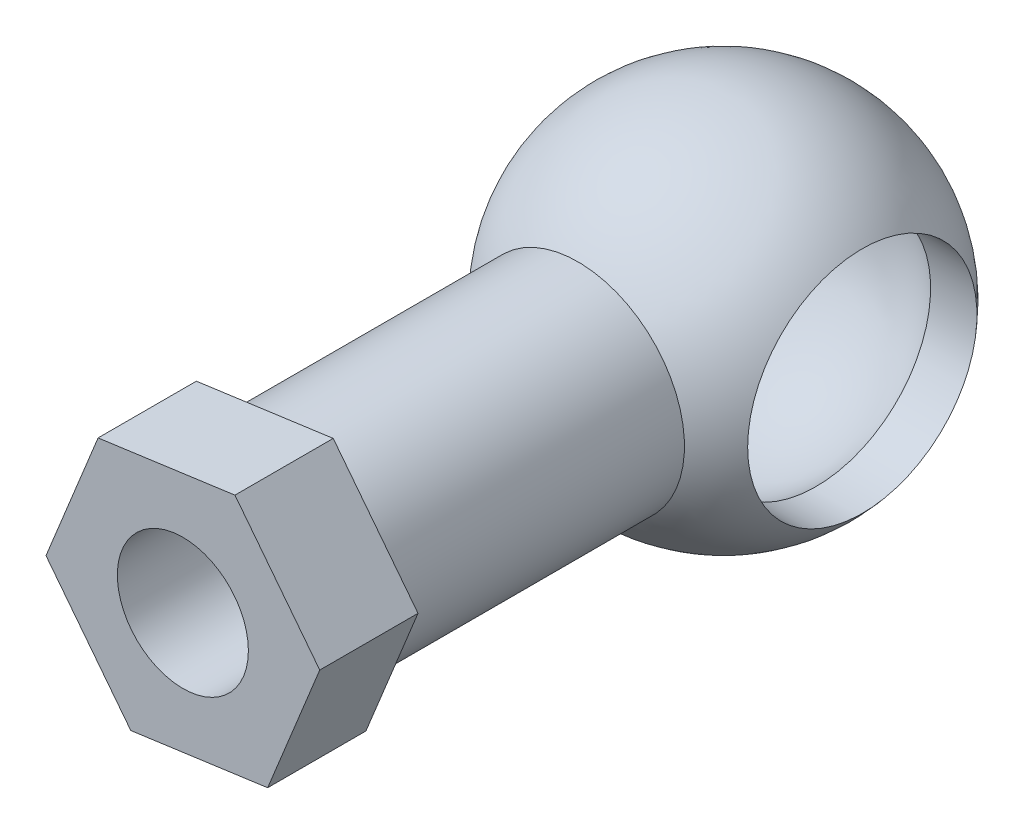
from build123d import *

# Parameters (mm, degrees)
ESQUISSE2_R      = 7
EXTRUSION1_DEPTH = 30
ESQUISSE4_R      = 4
EXTRUSION2_DEPTH = 6


with BuildPart() as part:
    # Esquisse1 → R_volution1 (revolve)
    with BuildSketch(Plane.XY):
        with BuildLine():
            Line((0, 11), (0, 9))
            ThreePointArc((0, 9), (-9, 0), (0, -9))
            Line((0, -9), (0, -11))
            ThreePointArc((0, -11), (-11, 0), (0, 11))
        make_face()
    revolve(axis=Axis((0, 19.125505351, 0), (0, -1, 0)))

    # Esquisse2 → Extrusion1 (cut)
    with BuildSketch(Plane(origin=(0, 0, 0), x_dir=(0, 0, -1), z_dir=(1, 0, 0))):
        with Locations(Location((0, 0, 0), (0, 0, 180))):
            Circle(ESQUISSE2_R)
    extrude(amount=EXTRUSION1_DEPTH, mode=Mode.SUBTRACT)

    # Esquisse3 → R_volution2 (revolve)
    with BuildSketch(Plane(origin=(0, 0, 0), x_dir=(1, 0, 0), z_dir=(0, 1, 0))):
        with BuildLine():
            Line((0, -11), (0, -27))
            Line((0, -27), (-6.5, -27))
            Line((-6.5, -27), (-6.5, -8.874119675))
            ThreePointArc((-6.5, -8.874119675), (-3.419406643, -10.455030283), (0, -11))
        make_face()
    revolve(axis=Axis((0, 0, 0), (0, 0, 1)))

    # Esquisse4 → Extrusion2 (add)
    with BuildSketch(Plane.XY.offset(27)):
        Polygon((5.177049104, -6.6612263), (8.357315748, 1.152842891), (3.180266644, 7.814069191), (-5.177049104, 6.6612263), (-8.357315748, -1.152842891), (-3.180266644, -7.814069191), align=None)
        Circle(ESQUISSE4_R, mode=Mode.SUBTRACT)
    extrude(amount=EXTRUSION2_DEPTH)


solid = part.part
